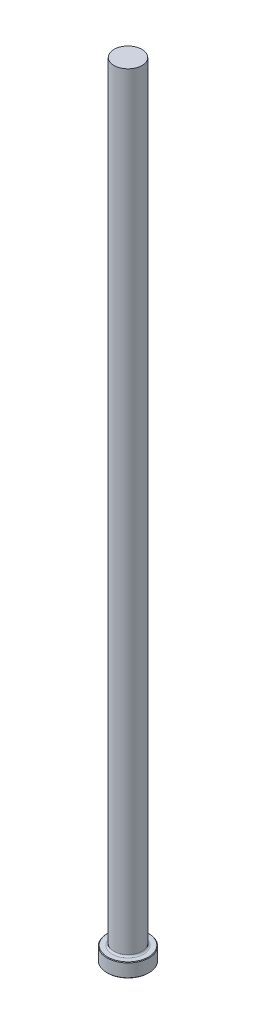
from build123d import *

# Parameters (mm, degrees)
CHAMFER1_SIZE = 0.254
FILLET1_R     = 0.762


with BuildPart() as part:
    # Sketch1 → Revolve1 (revolve)
    with BuildSketch(Plane.XY, mode=Mode.PRIVATE) as revolve1_sk:
        Polygon((0, 0), (-9.525, 0), (-9.525, 6.35), (-6.35, 6.35), (-6.35, 355.6), (0, 355.6), align=None)
    revolve(revolve1_sk.sketch.rotate(Axis((0, 259.958771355, 0), (0, -1, 0)), 270), axis=Axis((0, 259.958771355, 0), (0, -1, 0)))

    # Chamfer1
    chamfer1_edges = [part.edges().sort_by_distance(p)[0] for p in [
        (0, 6.35, -9.525),
        (0, 0, -9.525),
    ]]
    chamfer(chamfer1_edges, length=CHAMFER1_SIZE)

    # Fillet1
    fillet1_edges = [part.edges().sort_by_distance(p)[0] for p in [
        (0, 6.35, -6.35),
    ]]
    fillet(fillet1_edges, radius=FILLET1_R)


solid = part.part
